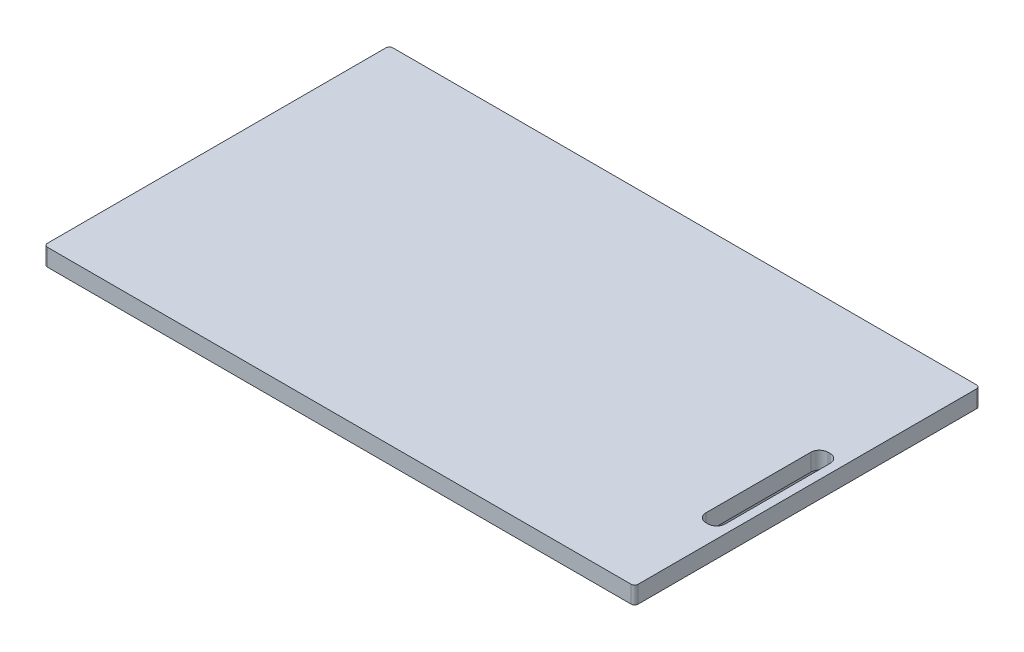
ISO-10303-21;
HEADER;
FILE_DESCRIPTION(('STEP AP214'),'2;1');
FILE_NAME('part.step','',(''),(''),'','','');
FILE_SCHEMA(('AUTOMOTIVE_DESIGN { 1 0 10303 214 1 1 1 1 }'));
ENDSEC;
DATA;
#1=APPLICATION_CONTEXT('core data for automotive mechanical design processes');
#2=APPLICATION_PROTOCOL_DEFINITION('international standard','automotive_design',2000,#1);
#3=PRODUCT_CONTEXT('',#1,'mechanical');
#4=PRODUCT('Part','Part','',(#3));
#5=PRODUCT_RELATED_PRODUCT_CATEGORY('part','',(#4));
#6=PRODUCT_DEFINITION_FORMATION('','',#4);
#7=PRODUCT_DEFINITION_CONTEXT('part definition',#1,'design');
#8=PRODUCT_DEFINITION('design','',#6,#7);
#9=PRODUCT_DEFINITION_SHAPE('','',#8);
#10=(LENGTH_UNIT() NAMED_UNIT(*) SI_UNIT(.MILLI.,.METRE.));
#11=(NAMED_UNIT(*) PLANE_ANGLE_UNIT() SI_UNIT($,.RADIAN.));
#12=(NAMED_UNIT(*) SI_UNIT($,.STERADIAN.) SOLID_ANGLE_UNIT());
#13=UNCERTAINTY_MEASURE_WITH_UNIT(LENGTH_MEASURE(1.E-05),#10,'distance_accuracy_value','');
#14=(GEOMETRIC_REPRESENTATION_CONTEXT(3) GLOBAL_UNCERTAINTY_ASSIGNED_CONTEXT((#13)) GLOBAL_UNIT_ASSIGNED_CONTEXT((#10,
#11,#12)) REPRESENTATION_CONTEXT('',''));
#15=CARTESIAN_POINT('',(0.,0.,0.));
#16=DIRECTION('',(0.,0.,1.));
#17=DIRECTION('',(1.,0.,0.));
#18=AXIS2_PLACEMENT_3D('',#15,#16,#17);
#19=CARTESIAN_POINT('',(-171.,19.,-100.));
#20=DIRECTION('',(0.,0.,1.));
#21=DIRECTION('',(1.,0.,0.));
#22=AXIS2_PLACEMENT_3D('',#19,#20,#21);
#23=PLANE('',#22);
#24=DIRECTION('',(1.,0.,0.));
#25=VECTOR('',#24,1.);
#26=CARTESIAN_POINT('',(-171.,9.,-100.));
#27=LINE('',#26,#25);
#28=CARTESIAN_POINT('',(-169.,9.,-100.));
#29=VERTEX_POINT('',#28);
#30=CARTESIAN_POINT('',(169.,9.,-100.));
#31=VERTEX_POINT('',#30);
#32=EDGE_CURVE('E346',#29,#31,#27,.T.);
#33=ORIENTED_EDGE('',*,*,#32,.F.);
#34=DIRECTION('',(0.,-1.,0.));
#35=VECTOR('',#34,1.);
#36=CARTESIAN_POINT('',(-169.,19.,-100.));
#37=LINE('',#36,#35);
#38=CARTESIAN_POINT('',(-169.,19.,-100.));
#39=VERTEX_POINT('',#38);
#40=EDGE_CURVE('E274',#29,#39,#37,.F.);
#41=ORIENTED_EDGE('',*,*,#40,.T.);
#42=DIRECTION('',(-1.,0.,0.));
#43=VECTOR('',#42,1.);
#44=CARTESIAN_POINT('',(-171.,19.,-100.));
#45=LINE('',#44,#43);
#46=CARTESIAN_POINT('',(169.,19.,-100.));
#47=VERTEX_POINT('',#46);
#48=EDGE_CURVE('E376',#47,#39,#45,.T.);
#49=ORIENTED_EDGE('',*,*,#48,.F.);
#50=DIRECTION('',(0.,-1.,0.));
#51=VECTOR('',#50,1.);
#52=CARTESIAN_POINT('',(169.,19.,-100.));
#53=LINE('',#52,#51);
#54=EDGE_CURVE('E271',#47,#31,#53,.T.);
#55=ORIENTED_EDGE('',*,*,#54,.T.);
#56=EDGE_LOOP('',(#33,#41,#49,#55));
#57=FACE_BOUND('',#56,.T.);
#58=ADVANCED_FACE('F35',(#57),#23,.F.);
#59=CARTESIAN_POINT('',(-171.,19.,100.));
#60=DIRECTION('',(1.,0.,0.));
#61=DIRECTION('',(0.,0.,-1.));
#62=AXIS2_PLACEMENT_3D('',#59,#60,#61);
#63=PLANE('',#62);
#64=DIRECTION('',(0.,0.,1.));
#65=VECTOR('',#64,1.);
#66=CARTESIAN_POINT('',(-171.,19.,100.));
#67=LINE('',#66,#65);
#68=CARTESIAN_POINT('',(-171.,19.,-98.));
#69=VERTEX_POINT('',#68);
#70=CARTESIAN_POINT('',(-171.,19.,98.));
#71=VERTEX_POINT('',#70);
#72=EDGE_CURVE('E379',#69,#71,#67,.T.);
#73=ORIENTED_EDGE('',*,*,#72,.F.);
#74=DIRECTION('',(0.,-1.,0.));
#75=VECTOR('',#74,1.);
#76=CARTESIAN_POINT('',(-171.,19.,-98.));
#77=LINE('',#76,#75);
#78=CARTESIAN_POINT('',(-171.,9.,-98.));
#79=VERTEX_POINT('',#78);
#80=EDGE_CURVE('E260',#69,#79,#77,.T.);
#81=ORIENTED_EDGE('',*,*,#80,.T.);
#82=DIRECTION('',(0.,0.,-1.));
#83=VECTOR('',#82,1.);
#84=CARTESIAN_POINT('',(-171.,9.,100.));
#85=LINE('',#84,#83);
#86=CARTESIAN_POINT('',(-171.,9.,98.));
#87=VERTEX_POINT('',#86);
#88=EDGE_CURVE('E343',#87,#79,#85,.T.);
#89=ORIENTED_EDGE('',*,*,#88,.F.);
#90=DIRECTION('',(0.,-1.,0.));
#91=VECTOR('',#90,1.);
#92=CARTESIAN_POINT('',(-171.,19.,98.));
#93=LINE('',#92,#91);
#94=EDGE_CURVE('E258',#87,#71,#93,.F.);
#95=ORIENTED_EDGE('',*,*,#94,.T.);
#96=EDGE_LOOP('',(#73,#81,#89,#95));
#97=FACE_BOUND('',#96,.T.);
#98=ADVANCED_FACE('F430',(#97),#63,.F.);
#99=CARTESIAN_POINT('',(-171.,19.,100.));
#100=DIRECTION('',(0.,0.,-1.));
#101=DIRECTION('',(-1.,0.,0.));
#102=AXIS2_PLACEMENT_3D('',#99,#100,#101);
#103=PLANE('',#102);
#104=DIRECTION('',(-1.,0.,0.));
#105=VECTOR('',#104,1.);
#106=CARTESIAN_POINT('',(-171.,9.,100.));
#107=LINE('',#106,#105);
#108=CARTESIAN_POINT('',(169.,9.,100.));
#109=VERTEX_POINT('',#108);
#110=CARTESIAN_POINT('',(-169.,9.,100.));
#111=VERTEX_POINT('',#110);
#112=EDGE_CURVE('E352',#109,#111,#107,.T.);
#113=ORIENTED_EDGE('',*,*,#112,.F.);
#114=DIRECTION('',(0.,-1.,0.));
#115=VECTOR('',#114,1.);
#116=CARTESIAN_POINT('',(169.,19.,100.));
#117=LINE('',#116,#115);
#118=CARTESIAN_POINT('',(169.,19.,100.));
#119=VERTEX_POINT('',#118);
#120=EDGE_CURVE('E300',#109,#119,#117,.F.);
#121=ORIENTED_EDGE('',*,*,#120,.T.);
#122=DIRECTION('',(1.,0.,0.));
#123=VECTOR('',#122,1.);
#124=CARTESIAN_POINT('',(-171.,19.,100.));
#125=LINE('',#124,#123);
#126=CARTESIAN_POINT('',(-169.,19.,100.));
#127=VERTEX_POINT('',#126);
#128=EDGE_CURVE('E382',#127,#119,#125,.T.);
#129=ORIENTED_EDGE('',*,*,#128,.F.);
#130=DIRECTION('',(0.,-1.,0.));
#131=VECTOR('',#130,1.);
#132=CARTESIAN_POINT('',(-169.,19.,100.));
#133=LINE('',#132,#131);
#134=EDGE_CURVE('E297',#127,#111,#133,.T.);
#135=ORIENTED_EDGE('',*,*,#134,.T.);
#136=EDGE_LOOP('',(#113,#121,#129,#135));
#137=FACE_BOUND('',#136,.T.);
#138=ADVANCED_FACE('F437',(#137),#103,.F.);
#139=CARTESIAN_POINT('',(171.,19.,100.));
#140=DIRECTION('',(-1.,0.,0.));
#141=DIRECTION('',(0.,0.,1.));
#142=AXIS2_PLACEMENT_3D('',#139,#140,#141);
#143=PLANE('',#142);
#144=DIRECTION('',(0.,0.,1.));
#145=VECTOR('',#144,1.);
#146=CARTESIAN_POINT('',(171.,9.,100.));
#147=LINE('',#146,#145);
#148=CARTESIAN_POINT('',(171.,9.,-98.));
#149=VERTEX_POINT('',#148);
#150=CARTESIAN_POINT('',(171.,9.,98.));
#151=VERTEX_POINT('',#150);
#152=EDGE_CURVE('E349',#149,#151,#147,.T.);
#153=ORIENTED_EDGE('',*,*,#152,.F.);
#154=DIRECTION('',(0.,-1.,0.));
#155=VECTOR('',#154,1.);
#156=CARTESIAN_POINT('',(171.,19.,-98.));
#157=LINE('',#156,#155);
#158=CARTESIAN_POINT('',(171.,19.,-98.));
#159=VERTEX_POINT('',#158);
#160=EDGE_CURVE('E50',#149,#159,#157,.F.);
#161=ORIENTED_EDGE('',*,*,#160,.T.);
#162=DIRECTION('',(0.,0.,-1.));
#163=VECTOR('',#162,1.);
#164=CARTESIAN_POINT('',(171.,19.,100.));
#165=LINE('',#164,#163);
#166=CARTESIAN_POINT('',(171.,19.,98.));
#167=VERTEX_POINT('',#166);
#168=EDGE_CURVE('E384',#167,#159,#165,.T.);
#169=ORIENTED_EDGE('',*,*,#168,.F.);
#170=DIRECTION('',(0.,-1.,0.));
#171=VECTOR('',#170,1.);
#172=CARTESIAN_POINT('',(171.,19.,98.));
#173=LINE('',#172,#171);
#174=EDGE_CURVE('E288',#167,#151,#173,.T.);
#175=ORIENTED_EDGE('',*,*,#174,.T.);
#176=EDGE_LOOP('',(#153,#161,#169,#175));
#177=FACE_BOUND('',#176,.T.);
#178=ADVANCED_FACE('F426',(#177),#143,.F.);
#179=CARTESIAN_POINT('',(154.8,-0.001000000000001,-23.2));
#180=DIRECTION('',(-1.,0.,0.));
#181=DIRECTION('',(0.,0.,1.));
#182=AXIS2_PLACEMENT_3D('',#179,#180,#181);
#183=PLANE('',#182);
#184=DIRECTION('',(0.,0.,1.));
#185=VECTOR('',#184,1.);
#186=CARTESIAN_POINT('',(154.8,9.,-23.2));
#187=LINE('',#186,#185);
#188=CARTESIAN_POINT('',(154.8,9.,-18.2));
#189=VERTEX_POINT('',#188);
#190=CARTESIAN_POINT('',(154.8,9.,42.5));
#191=VERTEX_POINT('',#190);
#192=EDGE_CURVE('E199',#189,#191,#187,.T.);
#193=ORIENTED_EDGE('',*,*,#192,.F.);
#194=DIRECTION('',(0.,1.,0.));
#195=VECTOR('',#194,1.);
#196=CARTESIAN_POINT('',(154.8,19.,-18.2));
#197=LINE('',#196,#195);
#198=CARTESIAN_POINT('',(154.8,19.,-18.2));
#199=VERTEX_POINT('',#198);
#200=EDGE_CURVE('E214',#189,#199,#197,.T.);
#201=ORIENTED_EDGE('',*,*,#200,.T.);
#202=DIRECTION('',(0.,0.,1.));
#203=VECTOR('',#202,1.);
#204=CARTESIAN_POINT('',(154.8,19.,-23.2));
#205=LINE('',#204,#203);
#206=CARTESIAN_POINT('',(154.8,19.,42.5));
#207=VERTEX_POINT('',#206);
#208=EDGE_CURVE('E365',#199,#207,#205,.T.);
#209=ORIENTED_EDGE('',*,*,#208,.T.);
#210=DIRECTION('',(0.,1.,0.));
#211=VECTOR('',#210,1.);
#212=CARTESIAN_POINT('',(154.8,0.,42.5));
#213=LINE('',#212,#211);
#214=EDGE_CURVE('E217',#207,#191,#213,.F.);
#215=ORIENTED_EDGE('',*,*,#214,.T.);
#216=EDGE_LOOP('',(#193,#201,#209,#215));
#217=FACE_BOUND('',#216,.T.);
#218=ADVANCED_FACE('F212',(#217),#183,.F.);
#219=CARTESIAN_POINT('',(154.8,-0.001000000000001,-23.2));
#220=DIRECTION('',(0.,0.,-1.));
#221=DIRECTION('',(-1.,0.,0.));
#222=AXIS2_PLACEMENT_3D('',#219,#220,#221);
#223=PLANE('',#222);
#224=DIRECTION('',(-1.,0.,0.));
#225=VECTOR('',#224,1.);
#226=CARTESIAN_POINT('',(154.8,9.,-23.2));
#227=LINE('',#226,#225);
#228=CARTESIAN_POINT('',(161.,9.,-23.2));
#229=VERTEX_POINT('',#228);
#230=CARTESIAN_POINT('',(159.8,9.,-23.2));
#231=VERTEX_POINT('',#230);
#232=EDGE_CURVE('E202',#229,#231,#227,.T.);
#233=ORIENTED_EDGE('',*,*,#232,.F.);
#234=DIRECTION('',(0.,1.,0.));
#235=VECTOR('',#234,1.);
#236=CARTESIAN_POINT('',(161.,19.,-23.2));
#237=LINE('',#236,#235);
#238=CARTESIAN_POINT('',(161.,19.,-23.2));
#239=VERTEX_POINT('',#238);
#240=EDGE_CURVE('E232',#229,#239,#237,.T.);
#241=ORIENTED_EDGE('',*,*,#240,.T.);
#242=DIRECTION('',(-1.,0.,0.));
#243=VECTOR('',#242,1.);
#244=CARTESIAN_POINT('',(154.8,19.,-23.2));
#245=LINE('',#244,#243);
#246=CARTESIAN_POINT('',(159.8,19.,-23.2));
#247=VERTEX_POINT('',#246);
#248=EDGE_CURVE('E373',#239,#247,#245,.T.);
#249=ORIENTED_EDGE('',*,*,#248,.T.);
#250=DIRECTION('',(0.,1.,0.));
#251=VECTOR('',#250,1.);
#252=CARTESIAN_POINT('',(159.8,0.,-23.2));
#253=LINE('',#252,#251);
#254=EDGE_CURVE('E224',#247,#231,#253,.F.);
#255=ORIENTED_EDGE('',*,*,#254,.T.);
#256=EDGE_LOOP('',(#233,#241,#249,#255));
#257=FACE_BOUND('',#256,.T.);
#258=ADVANCED_FACE('F418',(#257),#223,.F.);
#259=CARTESIAN_POINT('',(166.,-0.001000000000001,-23.2));
#260=DIRECTION('',(1.,0.,0.));
#261=DIRECTION('',(0.,0.,-1.));
#262=AXIS2_PLACEMENT_3D('',#259,#260,#261);
#263=PLANE('',#262);
#264=DIRECTION('',(0.,0.,-1.));
#265=VECTOR('',#264,1.);
#266=CARTESIAN_POINT('',(166.,9.,-23.2));
#267=LINE('',#266,#265);
#268=CARTESIAN_POINT('',(166.,9.,42.5));
#269=VERTEX_POINT('',#268);
#270=CARTESIAN_POINT('',(166.,9.,-18.2));
#271=VERTEX_POINT('',#270);
#272=EDGE_CURVE('E361',#269,#271,#267,.T.);
#273=ORIENTED_EDGE('',*,*,#272,.F.);
#274=DIRECTION('',(0.,1.,0.));
#275=VECTOR('',#274,1.);
#276=CARTESIAN_POINT('',(166.,19.,42.5));
#277=LINE('',#276,#275);
#278=CARTESIAN_POINT('',(166.,19.,42.5));
#279=VERTEX_POINT('',#278);
#280=EDGE_CURVE('E389',#269,#279,#277,.T.);
#281=ORIENTED_EDGE('',*,*,#280,.T.);
#282=DIRECTION('',(0.,0.,-1.));
#283=VECTOR('',#282,1.);
#284=CARTESIAN_POINT('',(166.,19.,-23.2));
#285=LINE('',#284,#283);
#286=CARTESIAN_POINT('',(166.,19.,-18.2));
#287=VERTEX_POINT('',#286);
#288=EDGE_CURVE('E370',#279,#287,#285,.T.);
#289=ORIENTED_EDGE('',*,*,#288,.T.);
#290=DIRECTION('',(0.,1.,0.));
#291=VECTOR('',#290,1.);
#292=CARTESIAN_POINT('',(166.,0.,-18.2));
#293=LINE('',#292,#291);
#294=EDGE_CURVE('E386',#287,#271,#293,.F.);
#295=ORIENTED_EDGE('',*,*,#294,.T.);
#296=EDGE_LOOP('',(#273,#281,#289,#295));
#297=FACE_BOUND('',#296,.T.);
#298=ADVANCED_FACE('F410',(#297),#263,.F.);
#299=CARTESIAN_POINT('',(154.8,-0.001000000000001,47.5));
#300=DIRECTION('',(0.,0.,1.));
#301=DIRECTION('',(1.,0.,0.));
#302=AXIS2_PLACEMENT_3D('',#299,#300,#301);
#303=PLANE('',#302);
#304=DIRECTION('',(1.,0.,0.));
#305=VECTOR('',#304,1.);
#306=CARTESIAN_POINT('',(154.8,9.,47.5));
#307=LINE('',#306,#305);
#308=CARTESIAN_POINT('',(159.8,9.,47.5));
#309=VERTEX_POINT('',#308);
#310=CARTESIAN_POINT('',(161.,9.,47.5));
#311=VERTEX_POINT('',#310);
#312=EDGE_CURVE('E359',#309,#311,#307,.T.);
#313=ORIENTED_EDGE('',*,*,#312,.F.);
#314=DIRECTION('',(0.,1.,0.));
#315=VECTOR('',#314,1.);
#316=CARTESIAN_POINT('',(159.8,19.,47.5));
#317=LINE('',#316,#315);
#318=CARTESIAN_POINT('',(159.8,19.,47.5));
#319=VERTEX_POINT('',#318);
#320=EDGE_CURVE('E227',#309,#319,#317,.T.);
#321=ORIENTED_EDGE('',*,*,#320,.T.);
#322=DIRECTION('',(1.,0.,0.));
#323=VECTOR('',#322,1.);
#324=CARTESIAN_POINT('',(154.8,19.,47.5));
#325=LINE('',#324,#323);
#326=CARTESIAN_POINT('',(161.,19.,47.5));
#327=VERTEX_POINT('',#326);
#328=EDGE_CURVE('E367',#319,#327,#325,.T.);
#329=ORIENTED_EDGE('',*,*,#328,.T.);
#330=DIRECTION('',(0.,1.,0.));
#331=VECTOR('',#330,1.);
#332=CARTESIAN_POINT('',(161.,0.,47.5));
#333=LINE('',#332,#331);
#334=EDGE_CURVE('E222',#327,#311,#333,.F.);
#335=ORIENTED_EDGE('',*,*,#334,.T.);
#336=EDGE_LOOP('',(#313,#321,#329,#335));
#337=FACE_BOUND('',#336,.T.);
#338=ADVANCED_FACE('F394',(#337),#303,.F.);
#339=CARTESIAN_POINT('',(161.,-0.001000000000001,42.5));
#340=DIRECTION('',(0.,-1.,0.));
#341=DIRECTION('',(0.,0.,-1.));
#342=AXIS2_PLACEMENT_3D('',#339,#340,#341);
#343=CYLINDRICAL_SURFACE('',#342,5.);
#344=CARTESIAN_POINT('',(161.,9.,42.5));
#345=DIRECTION('',(0.,-1.,0.));
#346=DIRECTION('',(0.,0.,-1.));
#347=AXIS2_PLACEMENT_3D('',#344,#345,#346);
#348=CIRCLE('',#347,5.);
#349=EDGE_CURVE('E363',#311,#269,#348,.F.);
#350=ORIENTED_EDGE('',*,*,#349,.F.);
#351=ORIENTED_EDGE('',*,*,#334,.F.);
#352=CARTESIAN_POINT('',(161.,19.,42.5));
#353=DIRECTION('',(0.,1.,0.));
#354=DIRECTION('',(0.,0.,1.));
#355=AXIS2_PLACEMENT_3D('',#352,#353,#354);
#356=CIRCLE('',#355,5.);
#357=EDGE_CURVE('E234',#279,#327,#356,.F.);
#358=ORIENTED_EDGE('',*,*,#357,.F.);
#359=ORIENTED_EDGE('',*,*,#280,.F.);
#360=EDGE_LOOP('',(#350,#351,#358,#359));
#361=FACE_BOUND('',#360,.T.);
#362=ADVANCED_FACE('F406',(#361),#343,.F.);
#363=CARTESIAN_POINT('',(159.8,-0.001000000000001,42.5));
#364=DIRECTION('',(0.,-1.,0.));
#365=DIRECTION('',(0.,0.,-1.));
#366=AXIS2_PLACEMENT_3D('',#363,#364,#365);
#367=CYLINDRICAL_SURFACE('',#366,5.);
#368=CARTESIAN_POINT('',(159.8,9.,42.5));
#369=DIRECTION('',(0.,-1.,0.));
#370=DIRECTION('',(0.,0.,-1.));
#371=AXIS2_PLACEMENT_3D('',#368,#369,#370);
#372=CIRCLE('',#371,5.);
#373=EDGE_CURVE('E357',#191,#309,#372,.F.);
#374=ORIENTED_EDGE('',*,*,#373,.F.);
#375=ORIENTED_EDGE('',*,*,#214,.F.);
#376=CARTESIAN_POINT('',(159.8,19.,42.5));
#377=DIRECTION('',(0.,1.,0.));
#378=DIRECTION('',(0.,0.,1.));
#379=AXIS2_PLACEMENT_3D('',#376,#377,#378);
#380=CIRCLE('',#379,5.);
#381=EDGE_CURVE('E236',#319,#207,#380,.F.);
#382=ORIENTED_EDGE('',*,*,#381,.F.);
#383=ORIENTED_EDGE('',*,*,#320,.F.);
#384=EDGE_LOOP('',(#374,#375,#382,#383));
#385=FACE_BOUND('',#384,.T.);
#386=ADVANCED_FACE('F398',(#385),#367,.F.);
#387=CARTESIAN_POINT('',(161.,-0.001000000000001,-18.2));
#388=DIRECTION('',(0.,-1.,0.));
#389=DIRECTION('',(0.,0.,-1.));
#390=AXIS2_PLACEMENT_3D('',#387,#388,#389);
#391=CYLINDRICAL_SURFACE('',#390,5.);
#392=CARTESIAN_POINT('',(161.,9.,-18.2));
#393=DIRECTION('',(0.,-1.,0.));
#394=DIRECTION('',(0.,0.,-1.));
#395=AXIS2_PLACEMENT_3D('',#392,#393,#394);
#396=CIRCLE('',#395,5.);
#397=EDGE_CURVE('E218',#271,#229,#396,.F.);
#398=ORIENTED_EDGE('',*,*,#397,.F.);
#399=ORIENTED_EDGE('',*,*,#294,.F.);
#400=CARTESIAN_POINT('',(161.,19.,-18.2));
#401=DIRECTION('',(0.,1.,0.));
#402=DIRECTION('',(0.,0.,1.));
#403=AXIS2_PLACEMENT_3D('',#400,#401,#402);
#404=CIRCLE('',#403,5.);
#405=EDGE_CURVE('E238',#239,#287,#404,.F.);
#406=ORIENTED_EDGE('',*,*,#405,.F.);
#407=ORIENTED_EDGE('',*,*,#240,.F.);
#408=EDGE_LOOP('',(#398,#399,#406,#407));
#409=FACE_BOUND('',#408,.T.);
#410=ADVANCED_FACE('F414',(#409),#391,.F.);
#411=CARTESIAN_POINT('',(159.8,-0.001000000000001,-18.2));
#412=DIRECTION('',(0.,-1.,0.));
#413=DIRECTION('',(0.,0.,-1.));
#414=AXIS2_PLACEMENT_3D('',#411,#412,#413);
#415=CYLINDRICAL_SURFACE('',#414,5.);
#416=CARTESIAN_POINT('',(159.8,9.,-18.2));
#417=DIRECTION('',(0.,-1.,0.));
#418=DIRECTION('',(0.,0.,-1.));
#419=AXIS2_PLACEMENT_3D('',#416,#417,#418);
#420=CIRCLE('',#419,5.);
#421=EDGE_CURVE('E196',#231,#189,#420,.F.);
#422=ORIENTED_EDGE('',*,*,#421,.F.);
#423=ORIENTED_EDGE('',*,*,#254,.F.);
#424=CARTESIAN_POINT('',(159.8,19.,-18.2));
#425=DIRECTION('',(0.,1.,0.));
#426=DIRECTION('',(0.,0.,1.));
#427=AXIS2_PLACEMENT_3D('',#424,#425,#426);
#428=CIRCLE('',#427,5.);
#429=EDGE_CURVE('E208',#199,#247,#428,.F.);
#430=ORIENTED_EDGE('',*,*,#429,.F.);
#431=ORIENTED_EDGE('',*,*,#200,.F.);
#432=EDGE_LOOP('',(#422,#423,#430,#431));
#433=FACE_BOUND('',#432,.T.);
#434=ADVANCED_FACE('F220',(#433),#415,.F.);
#435=CARTESIAN_POINT('',(0.,19.,0.));
#436=DIRECTION('',(0.,1.,0.));
#437=DIRECTION('',(0.,0.,1.));
#438=AXIS2_PLACEMENT_3D('',#435,#436,#437);
#439=PLANE('',#438);
#440=ORIENTED_EDGE('',*,*,#208,.F.);
#441=ORIENTED_EDGE('',*,*,#429,.T.);
#442=ORIENTED_EDGE('',*,*,#248,.F.);
#443=ORIENTED_EDGE('',*,*,#405,.T.);
#444=ORIENTED_EDGE('',*,*,#288,.F.);
#445=ORIENTED_EDGE('',*,*,#357,.T.);
#446=ORIENTED_EDGE('',*,*,#328,.F.);
#447=ORIENTED_EDGE('',*,*,#381,.T.);
#448=EDGE_LOOP('',(#440,#441,#442,#443,#444,#445,#446,#447));
#449=FACE_BOUND('',#448,.T.);
#450=ORIENTED_EDGE('',*,*,#48,.T.);
#451=CARTESIAN_POINT('',(-169.,19.,-98.));
#452=DIRECTION('',(0.,1.,0.));
#453=DIRECTION('',(0.,0.,1.));
#454=AXIS2_PLACEMENT_3D('',#451,#452,#453);
#455=CIRCLE('',#454,2.);
#456=EDGE_CURVE('E281',#39,#69,#455,.T.);
#457=ORIENTED_EDGE('',*,*,#456,.T.);
#458=ORIENTED_EDGE('',*,*,#72,.T.);
#459=CARTESIAN_POINT('',(-169.,19.,98.));
#460=DIRECTION('',(0.,1.,0.));
#461=DIRECTION('',(0.,0.,1.));
#462=AXIS2_PLACEMENT_3D('',#459,#460,#461);
#463=CIRCLE('',#462,2.);
#464=EDGE_CURVE('E276',#71,#127,#463,.T.);
#465=ORIENTED_EDGE('',*,*,#464,.T.);
#466=ORIENTED_EDGE('',*,*,#128,.T.);
#467=CARTESIAN_POINT('',(169.,19.,98.));
#468=DIRECTION('',(0.,1.,0.));
#469=DIRECTION('',(0.,0.,1.));
#470=AXIS2_PLACEMENT_3D('',#467,#468,#469);
#471=CIRCLE('',#470,2.);
#472=EDGE_CURVE('E57',#119,#167,#471,.T.);
#473=ORIENTED_EDGE('',*,*,#472,.T.);
#474=ORIENTED_EDGE('',*,*,#168,.T.);
#475=CARTESIAN_POINT('',(169.,19.,-98.));
#476=DIRECTION('',(0.,1.,0.));
#477=DIRECTION('',(0.,0.,1.));
#478=AXIS2_PLACEMENT_3D('',#475,#476,#477);
#479=CIRCLE('',#478,2.);
#480=EDGE_CURVE('E279',#159,#47,#479,.T.);
#481=ORIENTED_EDGE('',*,*,#480,.T.);
#482=EDGE_LOOP('',(#450,#457,#458,#465,#466,#473,#474,#481));
#483=FACE_BOUND('',#482,.T.);
#484=ADVANCED_FACE('F400',(#449,#483),#439,.T.);
#485=CARTESIAN_POINT('',(0.,9.,0.));
#486=DIRECTION('',(0.,-1.,0.));
#487=DIRECTION('',(0.,0.,-1.));
#488=AXIS2_PLACEMENT_3D('',#485,#486,#487);
#489=PLANE('',#488);
#490=ORIENTED_EDGE('',*,*,#88,.T.);
#491=CARTESIAN_POINT('',(-169.,9.,-98.));
#492=DIRECTION('',(0.,-1.,0.));
#493=DIRECTION('',(0.,0.,-1.));
#494=AXIS2_PLACEMENT_3D('',#491,#492,#493);
#495=CIRCLE('',#494,2.);
#496=EDGE_CURVE('E269',#79,#29,#495,.T.);
#497=ORIENTED_EDGE('',*,*,#496,.T.);
#498=ORIENTED_EDGE('',*,*,#32,.T.);
#499=CARTESIAN_POINT('',(169.,9.,-98.));
#500=DIRECTION('',(0.,-1.,0.));
#501=DIRECTION('',(0.,0.,-1.));
#502=AXIS2_PLACEMENT_3D('',#499,#500,#501);
#503=CIRCLE('',#502,2.);
#504=EDGE_CURVE('E267',#31,#149,#503,.T.);
#505=ORIENTED_EDGE('',*,*,#504,.T.);
#506=ORIENTED_EDGE('',*,*,#152,.T.);
#507=CARTESIAN_POINT('',(169.,9.,98.));
#508=DIRECTION('',(0.,-1.,0.));
#509=DIRECTION('',(0.,0.,-1.));
#510=AXIS2_PLACEMENT_3D('',#507,#508,#509);
#511=CIRCLE('',#510,2.);
#512=EDGE_CURVE('E265',#151,#109,#511,.T.);
#513=ORIENTED_EDGE('',*,*,#512,.T.);
#514=ORIENTED_EDGE('',*,*,#112,.T.);
#515=CARTESIAN_POINT('',(-169.,9.,98.));
#516=DIRECTION('',(0.,-1.,0.));
#517=DIRECTION('',(0.,0.,-1.));
#518=AXIS2_PLACEMENT_3D('',#515,#516,#517);
#519=CIRCLE('',#518,2.);
#520=EDGE_CURVE('E263',#111,#87,#519,.T.);
#521=ORIENTED_EDGE('',*,*,#520,.T.);
#522=EDGE_LOOP('',(#490,#497,#498,#505,#506,#513,#514,#521));
#523=FACE_BOUND('',#522,.T.);
#524=DIRECTION('',(-1.,0.,0.));
#525=VECTOR('',#524,1.);
#526=CARTESIAN_POINT('',(-151.5,9.,80.5));
#527=LINE('',#526,#525);
#528=CARTESIAN_POINT('',(149.5,9.,80.5));
#529=VERTEX_POINT('',#528);
#530=CARTESIAN_POINT('',(-149.5,9.,80.5));
#531=VERTEX_POINT('',#530);
#532=EDGE_CURVE('E313',#529,#531,#527,.T.);
#533=ORIENTED_EDGE('',*,*,#532,.F.);
#534=CARTESIAN_POINT('',(149.5,9.,78.5));
#535=DIRECTION('',(0.,-1.,0.));
#536=DIRECTION('',(0.,0.,-1.));
#537=AXIS2_PLACEMENT_3D('',#534,#535,#536);
#538=CIRCLE('',#537,2.);
#539=CARTESIAN_POINT('',(151.5,9.,78.5));
#540=VERTEX_POINT('',#539);
#541=EDGE_CURVE('E43',#529,#540,#538,.F.);
#542=ORIENTED_EDGE('',*,*,#541,.T.);
#543=DIRECTION('',(0.,0.,1.));
#544=VECTOR('',#543,1.);
#545=CARTESIAN_POINT('',(151.5,9.,80.5));
#546=LINE('',#545,#544);
#547=CARTESIAN_POINT('',(151.5,9.,-56.5));
#548=VERTEX_POINT('',#547);
#549=EDGE_CURVE('E310',#548,#540,#546,.T.);
#550=ORIENTED_EDGE('',*,*,#549,.F.);
#551=CARTESIAN_POINT('',(149.5,9.,-56.5));
#552=DIRECTION('',(0.,-1.,0.));
#553=DIRECTION('',(0.,0.,-1.));
#554=AXIS2_PLACEMENT_3D('',#551,#552,#553);
#555=CIRCLE('',#554,2.);
#556=CARTESIAN_POINT('',(149.5,9.,-58.5));
#557=VERTEX_POINT('',#556);
#558=EDGE_CURVE('E304',#548,#557,#555,.F.);
#559=ORIENTED_EDGE('',*,*,#558,.T.);
#560=DIRECTION('',(1.,0.,0.));
#561=VECTOR('',#560,1.);
#562=CARTESIAN_POINT('',(-151.5,9.,-58.5));
#563=LINE('',#562,#561);
#564=CARTESIAN_POINT('',(-149.5,9.,-58.5));
#565=VERTEX_POINT('',#564);
#566=EDGE_CURVE('E322',#565,#557,#563,.T.);
#567=ORIENTED_EDGE('',*,*,#566,.F.);
#568=CARTESIAN_POINT('',(-149.5,9.,-56.5));
#569=DIRECTION('',(0.,-1.,0.));
#570=DIRECTION('',(0.,0.,-1.));
#571=AXIS2_PLACEMENT_3D('',#568,#569,#570);
#572=CIRCLE('',#571,2.);
#573=CARTESIAN_POINT('',(-151.5,9.,-56.5));
#574=VERTEX_POINT('',#573);
#575=EDGE_CURVE('E302',#565,#574,#572,.F.);
#576=ORIENTED_EDGE('',*,*,#575,.T.);
#577=DIRECTION('',(0.,0.,-1.));
#578=VECTOR('',#577,1.);
#579=CARTESIAN_POINT('',(-151.5,9.,80.5));
#580=LINE('',#579,#578);
#581=CARTESIAN_POINT('',(-151.5,9.,78.5));
#582=VERTEX_POINT('',#581);
#583=EDGE_CURVE('E335',#582,#574,#580,.T.);
#584=ORIENTED_EDGE('',*,*,#583,.F.);
#585=CARTESIAN_POINT('',(-149.5,9.,78.5));
#586=DIRECTION('',(0.,-1.,0.));
#587=DIRECTION('',(0.,0.,-1.));
#588=AXIS2_PLACEMENT_3D('',#585,#586,#587);
#589=CIRCLE('',#588,2.);
#590=EDGE_CURVE('E11',#582,#531,#589,.F.);
#591=ORIENTED_EDGE('',*,*,#590,.T.);
#592=EDGE_LOOP('',(#533,#542,#550,#559,#567,#576,#584,#591));
#593=FACE_BOUND('',#592,.T.);
#594=ORIENTED_EDGE('',*,*,#349,.T.);
#595=ORIENTED_EDGE('',*,*,#272,.T.);
#596=ORIENTED_EDGE('',*,*,#397,.T.);
#597=ORIENTED_EDGE('',*,*,#232,.T.);
#598=ORIENTED_EDGE('',*,*,#421,.T.);
#599=ORIENTED_EDGE('',*,*,#192,.T.);
#600=ORIENTED_EDGE('',*,*,#373,.T.);
#601=ORIENTED_EDGE('',*,*,#312,.T.);
#602=EDGE_LOOP('',(#594,#595,#596,#597,#598,#599,#600,#601));
#603=FACE_BOUND('',#602,.T.);
#604=ADVANCED_FACE('F198',(#523,#593,#603),#489,.T.);
#605=CARTESIAN_POINT('',(-151.5,9.,80.5));
#606=DIRECTION('',(-1.,0.,0.));
#607=DIRECTION('',(0.,0.,1.));
#608=AXIS2_PLACEMENT_3D('',#605,#606,#607);
#609=PLANE('',#608);
#610=ORIENTED_EDGE('',*,*,#583,.T.);
#611=DIRECTION('',(0.,-1.,0.));
#612=VECTOR('',#611,1.);
#613=CARTESIAN_POINT('',(-151.5,9.,-56.5));
#614=LINE('',#613,#612);
#615=CARTESIAN_POINT('',(-151.5,0.,-56.5));
#616=VERTEX_POINT('',#615);
#617=EDGE_CURVE('E242',#574,#616,#614,.T.);
#618=ORIENTED_EDGE('',*,*,#617,.T.);
#619=DIRECTION('',(0.,0.,-1.));
#620=VECTOR('',#619,1.);
#621=CARTESIAN_POINT('',(-151.5,0.,80.5));
#622=LINE('',#621,#620);
#623=CARTESIAN_POINT('',(-151.5,0.,78.5));
#624=VERTEX_POINT('',#623);
#625=EDGE_CURVE('E485',#624,#616,#622,.T.);
#626=ORIENTED_EDGE('',*,*,#625,.F.);
#627=DIRECTION('',(0.,-1.,0.));
#628=VECTOR('',#627,1.);
#629=CARTESIAN_POINT('',(-151.5,9.,78.5));
#630=LINE('',#629,#628);
#631=EDGE_CURVE('E207',#624,#582,#630,.F.);
#632=ORIENTED_EDGE('',*,*,#631,.T.);
#633=EDGE_LOOP('',(#610,#618,#626,#632));
#634=FACE_BOUND('',#633,.T.);
#635=ADVANCED_FACE('F497',(#634),#609,.T.);
#636=CARTESIAN_POINT('',(-151.5,9.,80.5));
#637=DIRECTION('',(0.,0.,1.));
#638=DIRECTION('',(1.,0.,0.));
#639=AXIS2_PLACEMENT_3D('',#636,#637,#638);
#640=PLANE('',#639);
#641=DIRECTION('',(-1.,0.,0.));
#642=VECTOR('',#641,1.);
#643=CARTESIAN_POINT('',(-151.5,0.,80.5));
#644=LINE('',#643,#642);
#645=CARTESIAN_POINT('',(149.5,0.,80.5));
#646=VERTEX_POINT('',#645);
#647=CARTESIAN_POINT('',(-149.5,0.,80.5));
#648=VERTEX_POINT('',#647);
#649=EDGE_CURVE('E330',#646,#648,#644,.T.);
#650=ORIENTED_EDGE('',*,*,#649,.F.);
#651=DIRECTION('',(0.,-1.,0.));
#652=VECTOR('',#651,1.);
#653=CARTESIAN_POINT('',(149.5,9.,80.5));
#654=LINE('',#653,#652);
#655=EDGE_CURVE('E295',#646,#529,#654,.F.);
#656=ORIENTED_EDGE('',*,*,#655,.T.);
#657=ORIENTED_EDGE('',*,*,#532,.T.);
#658=DIRECTION('',(0.,-1.,0.));
#659=VECTOR('',#658,1.);
#660=CARTESIAN_POINT('',(-149.5,9.,80.5));
#661=LINE('',#660,#659);
#662=EDGE_CURVE('E292',#531,#648,#661,.T.);
#663=ORIENTED_EDGE('',*,*,#662,.T.);
#664=EDGE_LOOP('',(#650,#656,#657,#663));
#665=FACE_BOUND('',#664,.T.);
#666=ADVANCED_FACE('F333',(#665),#640,.T.);
#667=CARTESIAN_POINT('',(151.5,9.,80.5));
#668=DIRECTION('',(1.,0.,0.));
#669=DIRECTION('',(0.,0.,-1.));
#670=AXIS2_PLACEMENT_3D('',#667,#668,#669);
#671=PLANE('',#670);
#672=DIRECTION('',(0.,0.,1.));
#673=VECTOR('',#672,1.);
#674=CARTESIAN_POINT('',(151.5,0.,80.5));
#675=LINE('',#674,#673);
#676=CARTESIAN_POINT('',(151.5,0.,-56.5));
#677=VERTEX_POINT('',#676);
#678=CARTESIAN_POINT('',(151.5,0.,78.5));
#679=VERTEX_POINT('',#678);
#680=EDGE_CURVE('E331',#677,#679,#675,.T.);
#681=ORIENTED_EDGE('',*,*,#680,.F.);
#682=DIRECTION('',(0.,-1.,0.));
#683=VECTOR('',#682,1.);
#684=CARTESIAN_POINT('',(151.5,9.,-56.5));
#685=LINE('',#684,#683);
#686=EDGE_CURVE('E286',#677,#548,#685,.F.);
#687=ORIENTED_EDGE('',*,*,#686,.T.);
#688=ORIENTED_EDGE('',*,*,#549,.T.);
#689=DIRECTION('',(0.,-1.,0.));
#690=VECTOR('',#689,1.);
#691=CARTESIAN_POINT('',(151.5,9.,78.5));
#692=LINE('',#691,#690);
#693=EDGE_CURVE('E283',#540,#679,#692,.T.);
#694=ORIENTED_EDGE('',*,*,#693,.T.);
#695=EDGE_LOOP('',(#681,#687,#688,#694));
#696=FACE_BOUND('',#695,.T.);
#697=ADVANCED_FACE('F319',(#696),#671,.T.);
#698=CARTESIAN_POINT('',(-151.5,9.,-58.5));
#699=DIRECTION('',(0.,0.,-1.));
#700=DIRECTION('',(-1.,0.,0.));
#701=AXIS2_PLACEMENT_3D('',#698,#699,#700);
#702=PLANE('',#701);
#703=DIRECTION('',(1.,0.,0.));
#704=VECTOR('',#703,1.);
#705=CARTESIAN_POINT('',(-151.5,0.,-58.5));
#706=LINE('',#705,#704);
#707=CARTESIAN_POINT('',(-149.5,0.,-58.5));
#708=VERTEX_POINT('',#707);
#709=CARTESIAN_POINT('',(149.5,0.,-58.5));
#710=VERTEX_POINT('',#709);
#711=EDGE_CURVE('E339',#708,#710,#706,.T.);
#712=ORIENTED_EDGE('',*,*,#711,.F.);
#713=DIRECTION('',(0.,-1.,0.));
#714=VECTOR('',#713,1.);
#715=CARTESIAN_POINT('',(-149.5,9.,-58.5));
#716=LINE('',#715,#714);
#717=EDGE_CURVE('E256',#708,#565,#716,.F.);
#718=ORIENTED_EDGE('',*,*,#717,.T.);
#719=ORIENTED_EDGE('',*,*,#566,.T.);
#720=DIRECTION('',(0.,-1.,0.));
#721=VECTOR('',#720,1.);
#722=CARTESIAN_POINT('',(149.5,9.,-58.5));
#723=LINE('',#722,#721);
#724=EDGE_CURVE('E253',#557,#710,#723,.T.);
#725=ORIENTED_EDGE('',*,*,#724,.T.);
#726=EDGE_LOOP('',(#712,#718,#719,#725));
#727=FACE_BOUND('',#726,.T.);
#728=ADVANCED_FACE('F490',(#727),#702,.T.);
#729=CARTESIAN_POINT('',(0.,0.,0.));
#730=DIRECTION('',(0.,1.,0.));
#731=DIRECTION('',(0.,0.,1.));
#732=AXIS2_PLACEMENT_3D('',#729,#730,#731);
#733=PLANE('',#732);
#734=ORIENTED_EDGE('',*,*,#625,.T.);
#735=CARTESIAN_POINT('',(-149.5,0.,-56.5));
#736=DIRECTION('',(0.,1.,0.));
#737=DIRECTION('',(0.,0.,1.));
#738=AXIS2_PLACEMENT_3D('',#735,#736,#737);
#739=CIRCLE('',#738,2.);
#740=EDGE_CURVE('E251',#616,#708,#739,.F.);
#741=ORIENTED_EDGE('',*,*,#740,.T.);
#742=ORIENTED_EDGE('',*,*,#711,.T.);
#743=CARTESIAN_POINT('',(149.5,0.,-56.5));
#744=DIRECTION('',(0.,1.,0.));
#745=DIRECTION('',(0.,0.,1.));
#746=AXIS2_PLACEMENT_3D('',#743,#744,#745);
#747=CIRCLE('',#746,2.);
#748=EDGE_CURVE('E249',#710,#677,#747,.F.);
#749=ORIENTED_EDGE('',*,*,#748,.T.);
#750=ORIENTED_EDGE('',*,*,#680,.T.);
#751=CARTESIAN_POINT('',(149.5,0.,78.5));
#752=DIRECTION('',(0.,1.,0.));
#753=DIRECTION('',(0.,0.,1.));
#754=AXIS2_PLACEMENT_3D('',#751,#752,#753);
#755=CIRCLE('',#754,2.);
#756=EDGE_CURVE('E247',#679,#646,#755,.F.);
#757=ORIENTED_EDGE('',*,*,#756,.T.);
#758=ORIENTED_EDGE('',*,*,#649,.T.);
#759=CARTESIAN_POINT('',(-149.5,0.,78.5));
#760=DIRECTION('',(0.,1.,0.));
#761=DIRECTION('',(0.,0.,1.));
#762=AXIS2_PLACEMENT_3D('',#759,#760,#761);
#763=CIRCLE('',#762,2.);
#764=EDGE_CURVE('E245',#648,#624,#763,.F.);
#765=ORIENTED_EDGE('',*,*,#764,.T.);
#766=EDGE_LOOP('',(#734,#741,#742,#749,#750,#757,#758,#765));
#767=FACE_BOUND('',#766,.T.);
#768=ADVANCED_FACE('F329',(#767),#733,.F.);
#769=CARTESIAN_POINT('',(-149.5,9.,-56.5));
#770=DIRECTION('',(0.,-1.,0.));
#771=DIRECTION('',(0.,0.,-1.));
#772=AXIS2_PLACEMENT_3D('',#769,#770,#771);
#773=CYLINDRICAL_SURFACE('',#772,2.);
#774=ORIENTED_EDGE('',*,*,#575,.F.);
#775=ORIENTED_EDGE('',*,*,#717,.F.);
#776=ORIENTED_EDGE('',*,*,#740,.F.);
#777=ORIENTED_EDGE('',*,*,#617,.F.);
#778=EDGE_LOOP('',(#774,#775,#776,#777));
#779=FACE_BOUND('',#778,.T.);
#780=ADVANCED_FACE('F451',(#779),#773,.T.);
#781=CARTESIAN_POINT('',(-169.,19.,-98.));
#782=DIRECTION('',(0.,-1.,0.));
#783=DIRECTION('',(0.,0.,-1.));
#784=AXIS2_PLACEMENT_3D('',#781,#782,#783);
#785=CYLINDRICAL_SURFACE('',#784,2.);
#786=ORIENTED_EDGE('',*,*,#456,.F.);
#787=ORIENTED_EDGE('',*,*,#40,.F.);
#788=ORIENTED_EDGE('',*,*,#496,.F.);
#789=ORIENTED_EDGE('',*,*,#80,.F.);
#790=EDGE_LOOP('',(#786,#787,#788,#789));
#791=FACE_BOUND('',#790,.T.);
#792=ADVANCED_FACE('F454',(#791),#785,.T.);
#793=CARTESIAN_POINT('',(149.5,9.,-56.5));
#794=DIRECTION('',(0.,-1.,0.));
#795=DIRECTION('',(0.,0.,-1.));
#796=AXIS2_PLACEMENT_3D('',#793,#794,#795);
#797=CYLINDRICAL_SURFACE('',#796,2.);
#798=ORIENTED_EDGE('',*,*,#558,.F.);
#799=ORIENTED_EDGE('',*,*,#686,.F.);
#800=ORIENTED_EDGE('',*,*,#748,.F.);
#801=ORIENTED_EDGE('',*,*,#724,.F.);
#802=EDGE_LOOP('',(#798,#799,#800,#801));
#803=FACE_BOUND('',#802,.T.);
#804=ADVANCED_FACE('F458',(#803),#797,.T.);
#805=CARTESIAN_POINT('',(169.,19.,-98.));
#806=DIRECTION('',(0.,-1.,0.));
#807=DIRECTION('',(0.,0.,-1.));
#808=AXIS2_PLACEMENT_3D('',#805,#806,#807);
#809=CYLINDRICAL_SURFACE('',#808,2.);
#810=ORIENTED_EDGE('',*,*,#480,.F.);
#811=ORIENTED_EDGE('',*,*,#160,.F.);
#812=ORIENTED_EDGE('',*,*,#504,.F.);
#813=ORIENTED_EDGE('',*,*,#54,.F.);
#814=EDGE_LOOP('',(#810,#811,#812,#813));
#815=FACE_BOUND('',#814,.T.);
#816=ADVANCED_FACE('F462',(#815),#809,.T.);
#817=CARTESIAN_POINT('',(149.5,9.,78.5));
#818=DIRECTION('',(0.,-1.,0.));
#819=DIRECTION('',(0.,0.,-1.));
#820=AXIS2_PLACEMENT_3D('',#817,#818,#819);
#821=CYLINDRICAL_SURFACE('',#820,2.);
#822=ORIENTED_EDGE('',*,*,#541,.F.);
#823=ORIENTED_EDGE('',*,*,#655,.F.);
#824=ORIENTED_EDGE('',*,*,#756,.F.);
#825=ORIENTED_EDGE('',*,*,#693,.F.);
#826=EDGE_LOOP('',(#822,#823,#824,#825));
#827=FACE_BOUND('',#826,.T.);
#828=ADVANCED_FACE('F324',(#827),#821,.T.);
#829=CARTESIAN_POINT('',(169.,19.,98.));
#830=DIRECTION('',(0.,-1.,0.));
#831=DIRECTION('',(0.,0.,-1.));
#832=AXIS2_PLACEMENT_3D('',#829,#830,#831);
#833=CYLINDRICAL_SURFACE('',#832,2.);
#834=ORIENTED_EDGE('',*,*,#472,.F.);
#835=ORIENTED_EDGE('',*,*,#120,.F.);
#836=ORIENTED_EDGE('',*,*,#512,.F.);
#837=ORIENTED_EDGE('',*,*,#174,.F.);
#838=EDGE_LOOP('',(#834,#835,#836,#837));
#839=FACE_BOUND('',#838,.T.);
#840=ADVANCED_FACE('F469',(#839),#833,.T.);
#841=CARTESIAN_POINT('',(-149.5,9.,78.5));
#842=DIRECTION('',(0.,-1.,0.));
#843=DIRECTION('',(0.,0.,-1.));
#844=AXIS2_PLACEMENT_3D('',#841,#842,#843);
#845=CYLINDRICAL_SURFACE('',#844,2.);
#846=ORIENTED_EDGE('',*,*,#590,.F.);
#847=ORIENTED_EDGE('',*,*,#631,.F.);
#848=ORIENTED_EDGE('',*,*,#764,.F.);
#849=ORIENTED_EDGE('',*,*,#662,.F.);
#850=EDGE_LOOP('',(#846,#847,#848,#849));
#851=FACE_BOUND('',#850,.T.);
#852=ADVANCED_FACE('F471',(#851),#845,.T.);
#853=CARTESIAN_POINT('',(-169.,19.,98.));
#854=DIRECTION('',(0.,-1.,0.));
#855=DIRECTION('',(0.,0.,-1.));
#856=AXIS2_PLACEMENT_3D('',#853,#854,#855);
#857=CYLINDRICAL_SURFACE('',#856,2.);
#858=ORIENTED_EDGE('',*,*,#464,.F.);
#859=ORIENTED_EDGE('',*,*,#94,.F.);
#860=ORIENTED_EDGE('',*,*,#520,.F.);
#861=ORIENTED_EDGE('',*,*,#134,.F.);
#862=EDGE_LOOP('',(#858,#859,#860,#861));
#863=FACE_BOUND('',#862,.T.);
#864=ADVANCED_FACE('F37',(#863),#857,.T.);
#865=CLOSED_SHELL('',(#58,#98,#138,#178,#218,#258,#298,#338,#362,#386,#410,#434,#484,#604,#635,
#666,#697,#728,#768,#780,#792,#804,#816,#828,#840,#852,#864));
#866=MANIFOLD_SOLID_BREP('B2',#865);
#867=ADVANCED_BREP_SHAPE_REPRESENTATION('',(#18,#866),#14);
#868=SHAPE_DEFINITION_REPRESENTATION(#9,#867);
ENDSEC;
END-ISO-10303-21;
